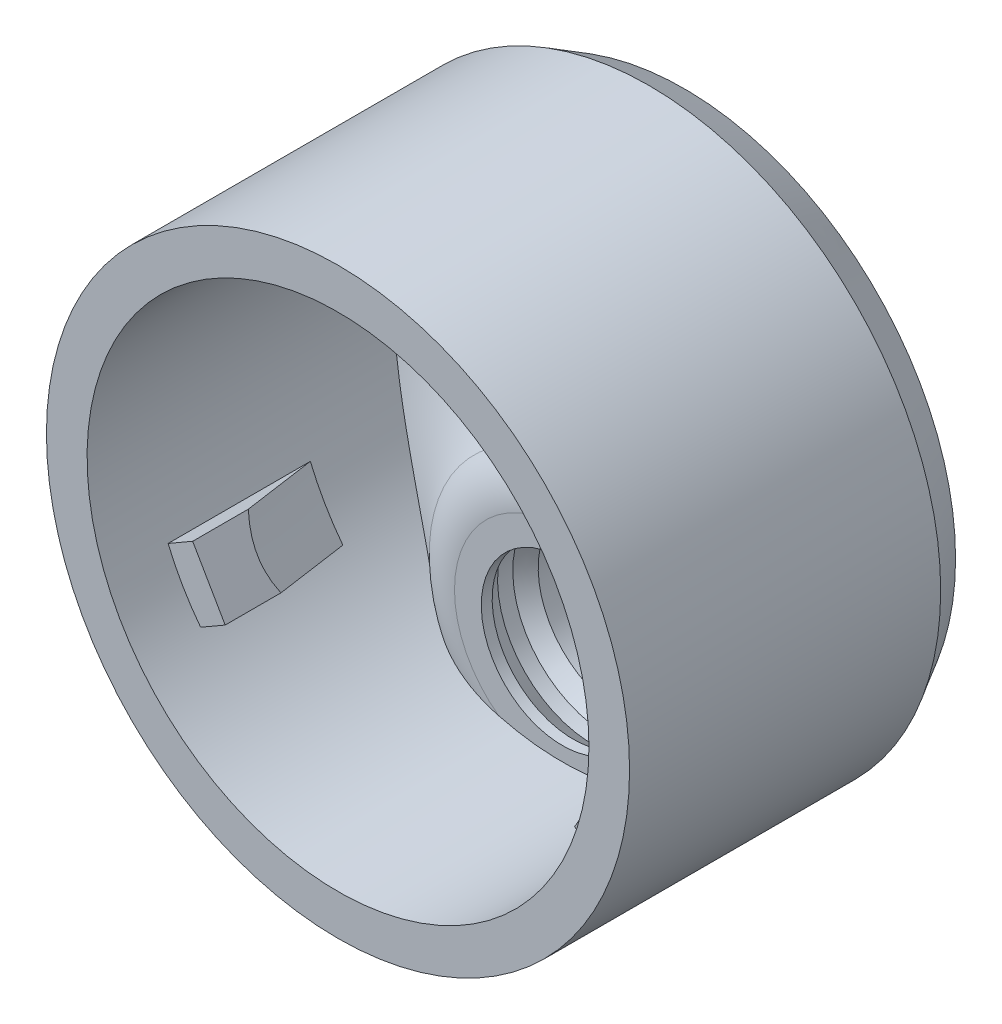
ISO-10303-21;
HEADER;
FILE_DESCRIPTION(('STEP AP214'),'2;1');
FILE_NAME('part.step','',(''),(''),'','','');
FILE_SCHEMA(('AUTOMOTIVE_DESIGN { 1 0 10303 214 1 1 1 1 }'));
ENDSEC;
DATA;
#1=APPLICATION_CONTEXT('core data for automotive mechanical design processes');
#2=APPLICATION_PROTOCOL_DEFINITION('international standard','automotive_design',2000,#1);
#3=PRODUCT_CONTEXT('',#1,'mechanical');
#4=PRODUCT('Part','Part','',(#3));
#5=PRODUCT_RELATED_PRODUCT_CATEGORY('part','',(#4));
#6=PRODUCT_DEFINITION_FORMATION('','',#4);
#7=PRODUCT_DEFINITION_CONTEXT('part definition',#1,'design');
#8=PRODUCT_DEFINITION('design','',#6,#7);
#9=PRODUCT_DEFINITION_SHAPE('','',#8);
#10=(LENGTH_UNIT() NAMED_UNIT(*) SI_UNIT(.MILLI.,.METRE.));
#11=(NAMED_UNIT(*) PLANE_ANGLE_UNIT() SI_UNIT($,.RADIAN.));
#12=(NAMED_UNIT(*) SI_UNIT($,.STERADIAN.) SOLID_ANGLE_UNIT());
#13=UNCERTAINTY_MEASURE_WITH_UNIT(LENGTH_MEASURE(1.E-05),#10,'distance_accuracy_value','');
#14=(GEOMETRIC_REPRESENTATION_CONTEXT(3) GLOBAL_UNCERTAINTY_ASSIGNED_CONTEXT((#13)) GLOBAL_UNIT_ASSIGNED_CONTEXT((#10,
#11,#12)) REPRESENTATION_CONTEXT('',''));
#15=CARTESIAN_POINT('',(0.,0.,0.));
#16=DIRECTION('',(0.,0.,1.));
#17=DIRECTION('',(1.,0.,0.));
#18=AXIS2_PLACEMENT_3D('',#15,#16,#17);
#19=CARTESIAN_POINT('',(0.,0.,17.0437230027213));
#20=DIRECTION('',(0.,0.,-1.));
#21=DIRECTION('',(-1.,0.,0.));
#22=AXIS2_PLACEMENT_3D('',#19,#20,#21);
#23=CYLINDRICAL_SURFACE('',#22,12.35);
#24=DIRECTION('',(0.,0.,-1.));
#25=VECTOR('',#24,1.);
#26=CARTESIAN_POINT('',(-11.405275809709,-4.7373181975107,17.0437230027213));
#27=LINE('',#26,#25);
#28=CARTESIAN_POINT('',(-11.405275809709,-4.7373181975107,6.99999999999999));
#29=VERTEX_POINT('',#28);
#30=CARTESIAN_POINT('',(-11.405275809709,-4.7373181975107,14.));
#31=VERTEX_POINT('',#30);
#32=EDGE_CURVE('E414',#29,#31,#27,.F.);
#33=ORIENTED_EDGE('',*,*,#32,.F.);
#34=CARTESIAN_POINT('',(0.,0.,6.99999999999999));
#35=DIRECTION('',(0.,0.,-1.));
#36=DIRECTION('',(-1.,0.,0.));
#37=AXIS2_PLACEMENT_3D('',#34,#35,#36);
#38=CIRCLE('',#37,12.35);
#39=CARTESIAN_POINT('',(-9.80527580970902,-7.5085994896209,6.99999999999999));
#40=VERTEX_POINT('',#39);
#41=EDGE_CURVE('E493',#29,#40,#38,.F.);
#42=ORIENTED_EDGE('',*,*,#41,.T.);
#43=DIRECTION('',(0.,0.,-1.));
#44=VECTOR('',#43,1.);
#45=CARTESIAN_POINT('',(-9.80527580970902,-7.5085994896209,17.0437230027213));
#46=LINE('',#45,#44);
#47=CARTESIAN_POINT('',(-9.80527580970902,-7.5085994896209,14.));
#48=VERTEX_POINT('',#47);
#49=EDGE_CURVE('E512',#48,#40,#46,.T.);
#50=ORIENTED_EDGE('',*,*,#49,.F.);
#51=CARTESIAN_POINT('',(0.,0.,14.));
#52=DIRECTION('',(0.,0.,-1.));
#53=DIRECTION('',(-1.,0.,0.));
#54=AXIS2_PLACEMENT_3D('',#51,#52,#53);
#55=CIRCLE('',#54,12.35);
#56=EDGE_CURVE('E521',#48,#31,#55,.T.);
#57=ORIENTED_EDGE('',*,*,#56,.T.);
#58=EDGE_LOOP('',(#33,#42,#50,#57));
#59=FACE_BOUND('',#58,.T.);
#60=CARTESIAN_POINT('',(12.3462335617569,0.304986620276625,2.));
#61=CARTESIAN_POINT('',(12.3539621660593,-0.00629316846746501,1.99999747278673));
#62=CARTESIAN_POINT('',(12.3498421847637,-0.317882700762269,2.0039492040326));
#63=CARTESIAN_POINT('',(12.3181249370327,-0.939653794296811,2.02057655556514));
#64=CARTESIAN_POINT('',(12.2905257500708,-1.24983523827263,2.03325288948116));
#65=CARTESIAN_POINT('',(12.2120462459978,-1.86688831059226,2.06815510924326));
#66=CARTESIAN_POINT('',(12.1611525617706,-2.17375793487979,2.09038647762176));
#67=CARTESIAN_POINT('',(12.0366053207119,-2.78189676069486,2.1451844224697));
#68=CARTESIAN_POINT('',(11.9629524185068,-3.08316612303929,2.17775070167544));
#69=CARTESIAN_POINT('',(11.7904002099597,-3.68945368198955,2.25542970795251));
#70=CARTESIAN_POINT('',(11.6906406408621,-3.99417218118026,2.30097589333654));
#71=CARTESIAN_POINT('',(11.4685779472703,-4.59306220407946,2.40478956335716));
#72=CARTESIAN_POINT('',(11.3462736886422,-4.88723319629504,2.46305768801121));
#73=CARTESIAN_POINT('',(11.0807830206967,-5.46250725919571,2.5929152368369));
#74=CARTESIAN_POINT('',(10.9376211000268,-5.74362515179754,2.66448906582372));
#75=CARTESIAN_POINT('',(10.6321278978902,-6.29115478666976,2.82155676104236));
#76=CARTESIAN_POINT('',(10.469797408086,-6.55756713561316,2.90705005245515));
#77=CARTESIAN_POINT('',(10.1317351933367,-7.06839698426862,3.09037909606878));
#78=CARTESIAN_POINT('',(9.95636570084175,-7.31316374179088,3.18791069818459));
#79=CARTESIAN_POINT('',(9.59146689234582,-7.7855859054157,3.3969292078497));
#80=CARTESIAN_POINT('',(9.40193724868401,-8.01324091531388,3.50841643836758));
#81=CARTESIAN_POINT('',(9.01083621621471,-8.4506521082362,3.74554036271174));
#82=CARTESIAN_POINT('',(8.80925026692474,-8.66038587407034,3.87119433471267));
#83=CARTESIAN_POINT('',(8.39670543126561,-9.0609314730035,4.13639641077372));
#84=CARTESIAN_POINT('',(8.18574774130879,-9.25174571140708,4.27594274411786));
#85=CARTESIAN_POINT('',(7.8019411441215,-9.57608639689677,4.53784952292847));
#86=CARTESIAN_POINT('',(7.63039128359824,-9.71322898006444,4.65766611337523));
#87=CARTESIAN_POINT('',(7.28411109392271,-9.97553987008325,4.90550788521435));
#88=CARTESIAN_POINT('',(7.10938092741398,-10.1007087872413,5.03353264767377));
#89=CARTESIAN_POINT('',(6.75843007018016,-10.3388073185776,5.29702664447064));
#90=CARTESIAN_POINT('',(6.58221638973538,-10.4517767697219,5.4324693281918));
#91=CARTESIAN_POINT('',(6.2287084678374,-10.66622986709,5.71076946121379));
#92=CARTESIAN_POINT('',(6.05141440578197,-10.7677153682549,5.85362570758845));
#93=CARTESIAN_POINT('',(5.87404565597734,-10.8636130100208,5.99999999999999));
#94=B_SPLINE_CURVE_WITH_KNOTS('',3,(#60,#61,#62,#63,#64,#65,#66,#67,#68,#69,#70,#71,#72,#73,#74,
#75,#76,#77,#78,#79,#80,#81,#82,#83,#84,#85,#86,#87,#88,#89,#90,#91,#92,#93),.UNSPECIFIED.,.F.,
.F.,(4,2,2,2,2,2,2,2,2,2,2,2,2,2,2,2,4),(0.,0.933903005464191,1.86788240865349,2.8023984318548,
3.73688757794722,4.7072327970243,5.67762684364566,6.64689061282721,7.61611436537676,
8.56454411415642,9.51299581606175,10.4626170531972,11.4121174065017,12.1622479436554,
12.9123402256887,13.6599039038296,14.4073466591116),.UNSPECIFIED.);
#95=CARTESIAN_POINT('',(12.3462335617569,0.304986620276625,2.));
#96=VERTEX_POINT('',#95);
#97=CARTESIAN_POINT('',(7.05222641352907,-10.1384714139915,5.07692307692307));
#98=VERTEX_POINT('',#97);
#99=EDGE_CURVE('E278',#96,#98,#94,.T.);
#100=ORIENTED_EDGE('',*,*,#99,.T.);
#101=CARTESIAN_POINT('',(7.05222641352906,-10.1384714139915,5.07692307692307));
#102=CARTESIAN_POINT('',(6.96275754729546,-10.2007302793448,5.14334075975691));
#103=CARTESIAN_POINT('',(6.87015922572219,-10.2633593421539,5.20500712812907));
#104=CARTESIAN_POINT('',(6.67968735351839,-10.38831512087,5.31950074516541));
#105=CARTESIAN_POINT('',(6.58182189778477,-10.4506421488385,5.37234107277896));
#106=CARTESIAN_POINT('',(6.38224641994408,-10.5736992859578,5.46968925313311));
#107=CARTESIAN_POINT('',(6.28056907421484,-10.6344376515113,5.51425424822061));
#108=CARTESIAN_POINT('',(6.07330104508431,-10.7541549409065,5.59620114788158));
#109=CARTESIAN_POINT('',(5.96770831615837,-10.8131329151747,5.63357923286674));
#110=CARTESIAN_POINT('',(5.68661083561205,-10.9646658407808,5.72291530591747));
#111=CARTESIAN_POINT('',(5.50838050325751,-11.0553479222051,5.7695290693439));
#112=CARTESIAN_POINT('',(5.14506224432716,-11.2290447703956,5.8479571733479));
#113=CARTESIAN_POINT('',(4.95997127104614,-11.3120560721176,5.87976485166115));
#114=CARTESIAN_POINT('',(4.58390332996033,-11.4696132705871,5.93101407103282));
#115=CARTESIAN_POINT('',(4.3929097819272,-11.544131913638,5.95041667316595));
#116=CARTESIAN_POINT('',(4.00677670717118,-11.6837665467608,5.97908334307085));
#117=CARTESIAN_POINT('',(3.81163679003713,-11.748881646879,5.98834645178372));
#118=CARTESIAN_POINT('',(3.53518465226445,-11.8335089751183,5.99595388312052));
#119=CARTESIAN_POINT('',(3.45517574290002,-11.8571169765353,5.99751555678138));
#120=CARTESIAN_POINT('',(3.29494592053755,-11.9026359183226,5.9995367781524));
#121=CARTESIAN_POINT('',(3.21472656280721,-11.9245521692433,5.99999992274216));
#122=CARTESIAN_POINT('',(3.1342898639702,-11.9456572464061,5.99999999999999));
#123=B_SPLINE_CURVE_WITH_KNOTS('',3,(#101,#102,#103,#104,#105,#106,#107,#108,#109,#110,#111,
#112,#113,#114,#115,#116,#117,#118,#119,#120,#121,#122),.UNSPECIFIED.,.F.,.F.,(4,2,2,2,2,2,2,2,
2,2,4),(0.,0.382653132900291,0.764734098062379,1.1440697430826,1.52360643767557,
2.13864248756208,2.75395501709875,3.3711896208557,3.98848260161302,4.23876604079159,
4.48822884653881),.UNSPECIFIED.);
#124=CARTESIAN_POINT('',(3.13428986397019,-11.9456572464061,5.99999999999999));
#125=VERTEX_POINT('',#124);
#126=EDGE_CURVE('E316',#98,#125,#123,.T.);
#127=ORIENTED_EDGE('',*,*,#126,.T.);
#128=CARTESIAN_POINT('',(0.,0.,5.99999999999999));
#129=DIRECTION('',(0.,0.,-1.));
#130=DIRECTION('',(0.,1.,0.));
#131=AXIS2_PLACEMENT_3D('',#128,#129,#130);
#132=CIRCLE('',#131,12.35);
#133=CARTESIAN_POINT('',(-3.13428986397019,-11.9456572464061,5.99999999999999));
#134=VERTEX_POINT('',#133);
#135=EDGE_CURVE('E274',#125,#134,#132,.T.);
#136=ORIENTED_EDGE('',*,*,#135,.T.);
#137=CARTESIAN_POINT('',(-3.1342898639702,-11.9456572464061,5.99999999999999));
#138=CARTESIAN_POINT('',(-3.35464931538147,-11.8878767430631,6.0000187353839));
#139=CARTESIAN_POINT('',(-3.57354760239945,-11.8238897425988,5.99652391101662));
#140=CARTESIAN_POINT('',(-4.00762094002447,-11.683893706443,5.97918363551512));
#141=CARTESIAN_POINT('',(-4.22278544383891,-11.6078553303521,5.96531260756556));
#142=CARTESIAN_POINT('',(-4.64070676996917,-11.4470477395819,5.92452526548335));
#143=CARTESIAN_POINT('',(-4.84364040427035,-11.3626348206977,5.89803962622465));
#144=CARTESIAN_POINT('',(-5.2423895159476,-11.1842496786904,5.82929715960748));
#145=CARTESIAN_POINT('',(-5.43821163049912,-11.0902866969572,5.78705547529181));
#146=CARTESIAN_POINT('',(-5.75742443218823,-10.9268145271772,5.70088381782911));
#147=CARTESIAN_POINT('',(-5.88334657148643,-10.8594984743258,5.66213494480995));
#148=CARTESIAN_POINT('',(-6.1302727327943,-10.7220434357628,5.57528026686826));
#149=CARTESIAN_POINT('',(-6.25127917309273,-10.6519058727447,5.52717913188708));
#150=CARTESIAN_POINT('',(-6.49001298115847,-10.5081857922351,5.41945198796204));
#151=CARTESIAN_POINT('',(-6.60761633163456,-10.4345617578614,5.35960313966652));
#152=CARTESIAN_POINT('',(-6.83568583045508,-10.2866261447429,5.22771563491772));
#153=CARTESIAN_POINT('',(-6.9461375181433,-10.2123135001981,5.1556532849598));
#154=CARTESIAN_POINT('',(-7.05222641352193,-10.1384714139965,5.07692307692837));
#155=B_SPLINE_CURVE_WITH_KNOTS('',3,(#137,#138,#139,#140,#141,#142,#143,#144,#145,#146,#147,
#148,#149,#150,#151,#152,#153,#154),.UNSPECIFIED.,.F.,.F.,(4,2,2,2,2,2,2,2,4),(0.,
0.683563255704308,1.36881703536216,2.03219080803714,2.69492865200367,3.13842914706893,
3.5817087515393,4.03439198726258,4.4879636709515),.UNSPECIFIED.);
#156=CARTESIAN_POINT('',(-7.05222641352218,-10.1384714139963,5.07692307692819));
#157=VERTEX_POINT('',#156);
#158=EDGE_CURVE('E322',#134,#157,#155,.T.);
#159=ORIENTED_EDGE('',*,*,#158,.T.);
#160=CARTESIAN_POINT('',(-5.87404565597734,-10.8636130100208,5.99999999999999));
#161=CARTESIAN_POINT('',(-6.00008280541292,-10.7954629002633,5.89600245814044));
#162=CARTESIAN_POINT('',(-6.12605683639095,-10.7245131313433,5.79378438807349));
#163=CARTESIAN_POINT('',(-6.37759460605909,-10.5768647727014,5.59302922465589));
#164=CARTESIAN_POINT('',(-6.5031582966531,-10.5001655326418,5.49449254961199));
#165=CARTESIAN_POINT('',(-6.87888971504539,-10.2611639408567,5.20452607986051));
#166=CARTESIAN_POINT('',(-7.12797144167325,-10.0900254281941,5.01884387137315));
#167=CARTESIAN_POINT('',(-7.62077294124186,-9.72321609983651,4.66342076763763));
#168=CARTESIAN_POINT('',(-7.86447613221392,-9.52747927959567,4.49372499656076));
#169=CARTESIAN_POINT('',(-8.34244687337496,-9.1118781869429,4.17157343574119));
#170=CARTESIAN_POINT('',(-8.57671684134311,-8.89202015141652,4.01911321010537));
#171=CARTESIAN_POINT('',(-9.03648869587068,-8.4245910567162,3.72922144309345));
#172=CARTESIAN_POINT('',(-9.26175959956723,-8.17659557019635,3.59210653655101));
#173=CARTESIAN_POINT('',(-9.69542297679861,-7.65739409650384,3.33617722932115));
#174=CARTESIAN_POINT('',(-9.90381332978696,-7.38618520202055,3.21736512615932));
#175=CARTESIAN_POINT('',(-10.2998672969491,-6.82301215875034,2.99806697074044));
#176=CARTESIAN_POINT('',(-10.4875732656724,-6.53109251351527,2.89754318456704));
#177=CARTESIAN_POINT('',(-10.8396937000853,-5.92834903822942,2.71402594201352));
#178=CARTESIAN_POINT('',(-11.0041116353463,-5.61752803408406,2.63102987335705));
#179=CARTESIAN_POINT('',(-11.2906292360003,-5.01431023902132,2.48991406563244));
#180=CARTESIAN_POINT('',(-11.4153846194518,-4.72357167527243,2.43007254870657));
#181=CARTESIAN_POINT('',(-11.6428178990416,-4.13133073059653,2.32306845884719));
#182=CARTESIAN_POINT('',(-11.7454966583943,-3.82982877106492,2.27590539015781));
#183=CARTESIAN_POINT('',(-11.9275798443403,-3.21825244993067,2.19351049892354));
#184=CARTESIAN_POINT('',(-12.0069815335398,-2.90817708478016,2.15828007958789));
#185=CARTESIAN_POINT('',(-12.1415831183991,-2.28189278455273,2.0989533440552));
#186=CARTESIAN_POINT('',(-12.1967906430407,-1.96568581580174,2.07485351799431));
#187=CARTESIAN_POINT('',(-12.2831462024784,-1.32410417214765,2.03660033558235));
#188=CARTESIAN_POINT('',(-12.3138876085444,-0.998664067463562,2.02261542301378));
#189=CARTESIAN_POINT('',(-12.3405518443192,-0.509766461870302,2.00889390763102));
#190=CARTESIAN_POINT('',(-12.3462035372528,-0.346877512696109,2.00552907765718));
#191=CARTESIAN_POINT('',(-12.3510571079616,-0.020976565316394,2.00108242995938));
#192=CARTESIAN_POINT('',(-12.3502591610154,0.142035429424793,2.00000055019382));
#193=CARTESIAN_POINT('',(-12.3462335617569,0.304986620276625,2.));
#194=B_SPLINE_CURVE_WITH_KNOTS('',3,(#160,#161,#162,#163,#164,#165,#166,#167,#168,#169,#170,
#171,#172,#173,#174,#175,#176,#177,#178,#179,#180,#181,#182,#183,#184,#185,#186,#187,#188,#189,
#190,#191,#192,#193),.UNSPECIFIED.,.F.,.F.,(4,2,2,2,2,2,2,2,2,2,2,2,2,2,2,2,4),(0.,
0.53107736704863,1.06221489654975,2.12501983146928,3.19074004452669,4.25618534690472,
5.34063820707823,6.42522708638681,7.50755212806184,8.589715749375,9.55450454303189,
10.5192556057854,11.4841200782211,12.4486800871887,13.4289546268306,13.9178964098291,
14.4068249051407),.UNSPECIFIED.);
#195=CARTESIAN_POINT('',(-12.3462335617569,0.304986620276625,2.));
#196=VERTEX_POINT('',#195);
#197=EDGE_CURVE('E287',#157,#196,#194,.T.);
#198=ORIENTED_EDGE('',*,*,#197,.T.);
#199=CARTESIAN_POINT('',(0.,0.,2.));
#200=DIRECTION('',(0.,0.,-1.));
#201=DIRECTION('',(-1.,0.,0.));
#202=AXIS2_PLACEMENT_3D('',#199,#200,#201);
#203=CIRCLE('',#202,12.35);
#204=EDGE_CURVE('E232',#196,#96,#203,.T.);
#205=ORIENTED_EDGE('',*,*,#204,.T.);
#206=EDGE_LOOP('',(#100,#127,#136,#159,#198,#205));
#207=FACE_BOUND('',#206,.T.);
#208=CARTESIAN_POINT('',(0.,0.,17.0437230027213));
#209=DIRECTION('',(0.,0.,1.));
#210=DIRECTION('',(1.,0.,0.));
#211=AXIS2_PLACEMENT_3D('',#208,#209,#210);
#212=CIRCLE('',#211,12.35);
#213=CARTESIAN_POINT('',(12.35,0.,17.0437230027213));
#214=VERTEX_POINT('',#213);
#215=EDGE_CURVE('E266',#214,#214,#212,.T.);
#216=ORIENTED_EDGE('',*,*,#215,.T.);
#217=EDGE_LOOP('',(#216));
#218=FACE_BOUND('',#217,.T.);
#219=DIRECTION('',(0.,0.,-1.));
#220=VECTOR('',#219,1.);
#221=CARTESIAN_POINT('',(1.6,12.2459176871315,17.0437230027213));
#222=LINE('',#221,#220);
#223=CARTESIAN_POINT('',(1.6,12.2459176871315,6.99999999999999));
#224=VERTEX_POINT('',#223);
#225=CARTESIAN_POINT('',(1.6,12.2459176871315,14.));
#226=VERTEX_POINT('',#225);
#227=EDGE_CURVE('E331',#224,#226,#222,.F.);
#228=ORIENTED_EDGE('',*,*,#227,.F.);
#229=CARTESIAN_POINT('',(0.,0.,6.99999999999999));
#230=DIRECTION('',(0.,0.,-1.));
#231=DIRECTION('',(-1.,0.,0.));
#232=AXIS2_PLACEMENT_3D('',#229,#230,#231);
#233=CIRCLE('',#232,12.35);
#234=CARTESIAN_POINT('',(-1.6,12.2459176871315,6.99999999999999));
#235=VERTEX_POINT('',#234);
#236=EDGE_CURVE('E337',#224,#235,#233,.F.);
#237=ORIENTED_EDGE('',*,*,#236,.T.);
#238=DIRECTION('',(0.,0.,-1.));
#239=VECTOR('',#238,1.);
#240=CARTESIAN_POINT('',(-1.6,12.2459176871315,17.0437230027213));
#241=LINE('',#240,#239);
#242=CARTESIAN_POINT('',(-1.6,12.2459176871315,14.));
#243=VERTEX_POINT('',#242);
#244=EDGE_CURVE('E328',#243,#235,#241,.T.);
#245=ORIENTED_EDGE('',*,*,#244,.F.);
#246=CARTESIAN_POINT('',(0.,0.,14.));
#247=DIRECTION('',(0.,0.,-1.));
#248=DIRECTION('',(-1.,0.,0.));
#249=AXIS2_PLACEMENT_3D('',#246,#247,#248);
#250=CIRCLE('',#249,12.35);
#251=EDGE_CURVE('E335',#243,#226,#250,.T.);
#252=ORIENTED_EDGE('',*,*,#251,.T.);
#253=EDGE_LOOP('',(#228,#237,#245,#252));
#254=FACE_BOUND('',#253,.T.);
#255=DIRECTION('',(0.,0.,-1.));
#256=VECTOR('',#255,1.);
#257=CARTESIAN_POINT('',(9.80527580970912,-7.50859948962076,17.0437230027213));
#258=LINE('',#257,#256);
#259=CARTESIAN_POINT('',(9.80527580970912,-7.50859948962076,6.99999999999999));
#260=VERTEX_POINT('',#259);
#261=CARTESIAN_POINT('',(9.80527580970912,-7.50859948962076,14.));
#262=VERTEX_POINT('',#261);
#263=EDGE_CURVE('E176',#260,#262,#258,.F.);
#264=ORIENTED_EDGE('',*,*,#263,.F.);
#265=CARTESIAN_POINT('',(0.,0.,6.99999999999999));
#266=DIRECTION('',(0.,0.,-1.));
#267=DIRECTION('',(-1.,0.,0.));
#268=AXIS2_PLACEMENT_3D('',#265,#266,#267);
#269=CIRCLE('',#268,12.35);
#270=CARTESIAN_POINT('',(11.4052758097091,-4.73731819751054,6.99999999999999));
#271=VERTEX_POINT('',#270);
#272=EDGE_CURVE('E424',#260,#271,#269,.F.);
#273=ORIENTED_EDGE('',*,*,#272,.T.);
#274=DIRECTION('',(0.,0.,-1.));
#275=VECTOR('',#274,1.);
#276=CARTESIAN_POINT('',(11.4052758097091,-4.73731819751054,17.0437230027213));
#277=LINE('',#276,#275);
#278=CARTESIAN_POINT('',(11.4052758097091,-4.73731819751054,14.));
#279=VERTEX_POINT('',#278);
#280=EDGE_CURVE('E427',#279,#271,#277,.T.);
#281=ORIENTED_EDGE('',*,*,#280,.F.);
#282=CARTESIAN_POINT('',(0.,0.,14.));
#283=DIRECTION('',(0.,0.,-1.));
#284=DIRECTION('',(-1.,0.,0.));
#285=AXIS2_PLACEMENT_3D('',#282,#283,#284);
#286=CIRCLE('',#285,12.35);
#287=EDGE_CURVE('E425',#279,#262,#286,.T.);
#288=ORIENTED_EDGE('',*,*,#287,.T.);
#289=EDGE_LOOP('',(#264,#273,#281,#288));
#290=FACE_BOUND('',#289,.T.);
#291=ADVANCED_FACE('F39',(#59,#207,#218,#254,#290),#23,.F.);
#292=CARTESIAN_POINT('',(0.,0.,17.0437230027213));
#293=DIRECTION('',(0.,0.,1.));
#294=DIRECTION('',(1.,0.,0.));
#295=AXIS2_PLACEMENT_3D('',#292,#293,#294);
#296=PLANE('',#295);
#297=CARTESIAN_POINT('',(0.,0.,17.0437230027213));
#298=DIRECTION('',(0.,0.,1.));
#299=DIRECTION('',(1.,0.,0.));
#300=AXIS2_PLACEMENT_3D('',#297,#298,#299);
#301=CIRCLE('',#300,14.35);
#302=CARTESIAN_POINT('',(14.35,0.,17.0437230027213));
#303=VERTEX_POINT('',#302);
#304=EDGE_CURVE('E270',#303,#303,#301,.T.);
#305=ORIENTED_EDGE('',*,*,#304,.T.);
#306=EDGE_LOOP('',(#305));
#307=FACE_BOUND('',#306,.T.);
#308=ORIENTED_EDGE('',*,*,#215,.F.);
#309=EDGE_LOOP('',(#308));
#310=FACE_BOUND('',#309,.T.);
#311=ADVANCED_FACE('F405',(#307,#310),#296,.T.);
#312=CARTESIAN_POINT('',(0.,0.,0.));
#313=DIRECTION('',(0.,0.,1.));
#314=DIRECTION('',(1.,0.,0.));
#315=AXIS2_PLACEMENT_3D('',#312,#313,#314);
#316=PLANE('',#315);
#317=CARTESIAN_POINT('',(0.,0.,0.));
#318=DIRECTION('',(0.,0.,1.));
#319=DIRECTION('',(1.,0.,0.));
#320=AXIS2_PLACEMENT_3D('',#317,#318,#319);
#321=CIRCLE('',#320,13.35);
#322=CARTESIAN_POINT('',(13.35,0.,0.));
#323=VERTEX_POINT('',#322);
#324=EDGE_CURVE('E11',#323,#323,#321,.F.);
#325=ORIENTED_EDGE('',*,*,#324,.T.);
#326=EDGE_LOOP('',(#325));
#327=FACE_BOUND('',#326,.T.);
#328=CARTESIAN_POINT('',(0.,-7.65835808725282,0.));
#329=DIRECTION('',(0.,0.,-1.));
#330=DIRECTION('',(0.,1.,0.));
#331=AXIS2_PLACEMENT_3D('',#328,#329,#330);
#332=CIRCLE('',#331,4.5);
#333=CARTESIAN_POINT('',(0.,-3.15835808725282,0.));
#334=VERTEX_POINT('',#333);
#335=EDGE_CURVE('E262',#334,#334,#332,.T.);
#336=ORIENTED_EDGE('',*,*,#335,.F.);
#337=EDGE_LOOP('',(#336));
#338=FACE_BOUND('',#337,.T.);
#339=ADVANCED_FACE('F400',(#327,#338),#316,.F.);
#340=CARTESIAN_POINT('',(0.,0.,17.0437230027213));
#341=DIRECTION('',(0.,0.,-1.));
#342=DIRECTION('',(-1.,0.,0.));
#343=AXIS2_PLACEMENT_3D('',#340,#341,#342);
#344=CYLINDRICAL_SURFACE('',#343,14.35);
#345=CARTESIAN_POINT('',(0.,0.,1.73205080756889));
#346=DIRECTION('',(0.,0.,1.));
#347=DIRECTION('',(1.,0.,0.));
#348=AXIS2_PLACEMENT_3D('',#345,#346,#347);
#349=CIRCLE('',#348,14.35);
#350=CARTESIAN_POINT('',(14.35,0.,1.73205080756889));
#351=VERTEX_POINT('',#350);
#352=EDGE_CURVE('E48',#351,#351,#349,.T.);
#353=ORIENTED_EDGE('',*,*,#352,.T.);
#354=EDGE_LOOP('',(#353));
#355=FACE_BOUND('',#354,.T.);
#356=ORIENTED_EDGE('',*,*,#304,.F.);
#357=EDGE_LOOP('',(#356));
#358=FACE_BOUND('',#357,.T.);
#359=ADVANCED_FACE('F303',(#355,#358),#344,.T.);
#360=CARTESIAN_POINT('',(0.,-7.65835808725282,0.));
#361=DIRECTION('',(0.,0.,-1.));
#362=DIRECTION('',(0.,1.,0.));
#363=AXIS2_PLACEMENT_3D('',#360,#361,#362);
#364=CONICAL_SURFACE('',#363,4.5,0.552620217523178);
#365=CARTESIAN_POINT('',(0.,-7.65835808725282,0.499999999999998));
#366=DIRECTION('',(0.,0.,-1.));
#367=DIRECTION('',(0.,1.,0.));
#368=AXIS2_PLACEMENT_3D('',#365,#366,#367);
#369=CIRCLE('',#368,4.19164191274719);
#370=CARTESIAN_POINT('',(0.,-3.46671617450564,0.499999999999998));
#371=VERTEX_POINT('',#370);
#372=EDGE_CURVE('E258',#371,#371,#369,.T.);
#373=ORIENTED_EDGE('',*,*,#372,.F.);
#374=EDGE_LOOP('',(#373));
#375=FACE_BOUND('',#374,.T.);
#376=ORIENTED_EDGE('',*,*,#335,.T.);
#377=EDGE_LOOP('',(#376));
#378=FACE_BOUND('',#377,.T.);
#379=ADVANCED_FACE('F393',(#375,#378),#364,.F.);
#380=CARTESIAN_POINT('',(0.,-7.65835808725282,-1.06047538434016));
#381=DIRECTION('',(0.,0.,-1.));
#382=DIRECTION('',(0.,1.,0.));
#383=AXIS2_PLACEMENT_3D('',#380,#381,#382);
#384=CYLINDRICAL_SURFACE('',#383,4.19164191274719);
#385=CARTESIAN_POINT('',(0.,-7.65835808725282,3.));
#386=DIRECTION('',(0.,0.,-1.));
#387=DIRECTION('',(0.,1.,0.));
#388=AXIS2_PLACEMENT_3D('',#385,#386,#387);
#389=CIRCLE('',#388,4.19164191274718);
#390=CARTESIAN_POINT('',(0.,-3.46671617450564,3.));
#391=VERTEX_POINT('',#390);
#392=EDGE_CURVE('E254',#391,#391,#389,.T.);
#393=ORIENTED_EDGE('',*,*,#392,.F.);
#394=EDGE_LOOP('',(#393));
#395=FACE_BOUND('',#394,.T.);
#396=ORIENTED_EDGE('',*,*,#372,.T.);
#397=EDGE_LOOP('',(#396));
#398=FACE_BOUND('',#397,.T.);
#399=ADVANCED_FACE('F390',(#395,#398),#384,.F.);
#400=CARTESIAN_POINT('',(0.,-7.65835808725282,3.));
#401=DIRECTION('',(0.,0.,1.));
#402=DIRECTION('',(0.,-1.,0.));
#403=AXIS2_PLACEMENT_3D('',#400,#401,#402);
#404=CONICAL_SURFACE('',#403,4.19164191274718,0.588002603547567);
#405=CARTESIAN_POINT('',(0.,-7.65835808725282,3.74999999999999));
#406=DIRECTION('',(0.,0.,-1.));
#407=DIRECTION('',(0.,1.,0.));
#408=AXIS2_PLACEMENT_3D('',#405,#406,#407);
#409=CIRCLE('',#408,4.69164191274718);
#410=CARTESIAN_POINT('',(0.,-2.96671617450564,3.74999999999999));
#411=VERTEX_POINT('',#410);
#412=EDGE_CURVE('E250',#411,#411,#409,.T.);
#413=ORIENTED_EDGE('',*,*,#412,.F.);
#414=EDGE_LOOP('',(#413));
#415=FACE_BOUND('',#414,.T.);
#416=ORIENTED_EDGE('',*,*,#392,.T.);
#417=EDGE_LOOP('',(#416));
#418=FACE_BOUND('',#417,.T.);
#419=ADVANCED_FACE('F386',(#415,#418),#404,.F.);
#420=CARTESIAN_POINT('',(0.,-7.65835808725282,-1.06047538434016));
#421=DIRECTION('',(0.,0.,-1.));
#422=DIRECTION('',(0.,1.,0.));
#423=AXIS2_PLACEMENT_3D('',#420,#421,#422);
#424=CYLINDRICAL_SURFACE('',#423,4.69164191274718);
#425=ORIENTED_EDGE('',*,*,#412,.T.);
#426=EDGE_LOOP('',(#425));
#427=FACE_BOUND('',#426,.T.);
#428=CARTESIAN_POINT('',(0.,-7.65835808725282,4.49999999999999));
#429=DIRECTION('',(0.,0.,-1.));
#430=DIRECTION('',(0.,1.,0.));
#431=AXIS2_PLACEMENT_3D('',#428,#429,#430);
#432=CIRCLE('',#431,4.69164191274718);
#433=CARTESIAN_POINT('',(0.,-2.96671617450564,4.49999999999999));
#434=VERTEX_POINT('',#433);
#435=EDGE_CURVE('E246',#434,#434,#432,.T.);
#436=ORIENTED_EDGE('',*,*,#435,.F.);
#437=EDGE_LOOP('',(#436));
#438=FACE_BOUND('',#437,.T.);
#439=ADVANCED_FACE('F382',(#427,#438),#424,.F.);
#440=CARTESIAN_POINT('',(0.,-7.65835808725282,4.49999999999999));
#441=DIRECTION('',(0.,0.,-1.));
#442=DIRECTION('',(0.,1.,0.));
#443=AXIS2_PLACEMENT_3D('',#440,#441,#442);
#444=CONICAL_SURFACE('',#443,4.69164191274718,0.627257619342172);
#445=CARTESIAN_POINT('',(0.,-7.65835808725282,5.46561999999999));
#446=DIRECTION('',(0.,0.,-1.));
#447=DIRECTION('',(0.,1.,0.));
#448=AXIS2_PLACEMENT_3D('',#445,#446,#447);
#449=CIRCLE('',#448,3.99164191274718);
#450=CARTESIAN_POINT('',(0.,-3.66671617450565,5.46561999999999));
#451=VERTEX_POINT('',#450);
#452=EDGE_CURVE('E242',#451,#451,#449,.T.);
#453=ORIENTED_EDGE('',*,*,#452,.F.);
#454=EDGE_LOOP('',(#453));
#455=FACE_BOUND('',#454,.T.);
#456=ORIENTED_EDGE('',*,*,#435,.T.);
#457=EDGE_LOOP('',(#456));
#458=FACE_BOUND('',#457,.T.);
#459=ADVANCED_FACE('F378',(#455,#458),#444,.F.);
#460=CARTESIAN_POINT('',(0.,-7.65835808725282,-1.06047538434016));
#461=DIRECTION('',(0.,0.,-1.));
#462=DIRECTION('',(0.,1.,0.));
#463=AXIS2_PLACEMENT_3D('',#460,#461,#462);
#464=CYLINDRICAL_SURFACE('',#463,3.99164191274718);
#465=CARTESIAN_POINT('',(0.,-7.65835808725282,5.99999999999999));
#466=DIRECTION('',(0.,0.,-1.));
#467=DIRECTION('',(0.,1.,0.));
#468=AXIS2_PLACEMENT_3D('',#465,#466,#467);
#469=CIRCLE('',#468,3.99164191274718);
#470=CARTESIAN_POINT('',(0.,-3.66671617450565,5.99999999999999));
#471=VERTEX_POINT('',#470);
#472=EDGE_CURVE('E238',#471,#471,#469,.T.);
#473=ORIENTED_EDGE('',*,*,#472,.F.);
#474=EDGE_LOOP('',(#473));
#475=FACE_BOUND('',#474,.T.);
#476=ORIENTED_EDGE('',*,*,#452,.T.);
#477=EDGE_LOOP('',(#476));
#478=FACE_BOUND('',#477,.T.);
#479=ADVANCED_FACE('F374',(#475,#478),#464,.F.);
#480=CARTESIAN_POINT('',(0.,-11.65,5.99999999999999));
#481=DIRECTION('',(0.,0.,-1.));
#482=DIRECTION('',(0.,1.,0.));
#483=AXIS2_PLACEMENT_3D('',#480,#481,#482);
#484=PLANE('',#483);
#485=ORIENTED_EDGE('',*,*,#135,.F.);
#486=CARTESIAN_POINT('',(0.,-7.65835808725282,5.99999999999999));
#487=DIRECTION('',(0.,0.,-1.));
#488=DIRECTION('',(0.,1.,0.));
#489=AXIS2_PLACEMENT_3D('',#486,#487,#488);
#490=CIRCLE('',#489,5.31081039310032);
#491=EDGE_CURVE('E761',#125,#134,#490,.F.);
#492=ORIENTED_EDGE('',*,*,#491,.T.);
#493=EDGE_LOOP('',(#485,#492));
#494=FACE_BOUND('',#493,.T.);
#495=ORIENTED_EDGE('',*,*,#472,.T.);
#496=EDGE_LOOP('',(#495));
#497=FACE_BOUND('',#496,.T.);
#498=ADVANCED_FACE('F370',(#494,#497),#484,.F.);
#499=CARTESIAN_POINT('',(0.,-3.82917904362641,2.));
#500=DIRECTION('',(0.,0.,-1.));
#501=DIRECTION('',(-1.,0.,0.));
#502=AXIS2_PLACEMENT_3D('',#499,#500,#501);
#503=PLANE('',#502);
#504=ORIENTED_EDGE('',*,*,#204,.F.);
#505=CARTESIAN_POINT('',(0.,-7.65835808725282,2.));
#506=DIRECTION('',(0.,0.,-1.));
#507=DIRECTION('',(-1.,0.,0.));
#508=AXIS2_PLACEMENT_3D('',#505,#506,#507);
#509=CIRCLE('',#508,14.6916419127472);
#510=EDGE_CURVE('E764',#196,#96,#509,.T.);
#511=ORIENTED_EDGE('',*,*,#510,.T.);
#512=EDGE_LOOP('',(#504,#511));
#513=FACE_BOUND('',#512,.T.);
#514=ADVANCED_FACE('F301',(#513),#503,.F.);
#515=CARTESIAN_POINT('',(0.,-7.65835808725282,12.));
#516=DIRECTION('',(0.,0.,-1.));
#517=DIRECTION('',(-1.,0.,0.));
#518=AXIS2_PLACEMENT_3D('',#515,#516,#517);
#519=TOROIDAL_SURFACE('',#518,14.6916419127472,10.);
#520=ORIENTED_EDGE('',*,*,#197,.F.);
#521=CARTESIAN_POINT('',(0.,-7.65835808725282,5.07692307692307));
#522=DIRECTION('',(0.,0.,1.));
#523=DIRECTION('',(0.,-1.,0.));
#524=AXIS2_PLACEMENT_3D('',#521,#522,#523);
#525=CIRCLE('',#524,7.47561766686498);
#526=EDGE_CURVE('E762',#157,#98,#525,.F.);
#527=ORIENTED_EDGE('',*,*,#526,.T.);
#528=ORIENTED_EDGE('',*,*,#99,.F.);
#529=ORIENTED_EDGE('',*,*,#510,.F.);
#530=EDGE_LOOP('',(#520,#527,#528,#529));
#531=FACE_BOUND('',#530,.T.);
#532=ADVANCED_FACE('F295',(#531),#519,.F.);
#533=CARTESIAN_POINT('',(0.,-7.65835808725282,2.99999999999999));
#534=DIRECTION('',(0.,0.,1.));
#535=DIRECTION('',(0.,-1.,0.));
#536=AXIS2_PLACEMENT_3D('',#533,#534,#535);
#537=TOROIDAL_SURFACE('',#536,5.31081039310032,3.);
#538=ORIENTED_EDGE('',*,*,#158,.F.);
#539=ORIENTED_EDGE('',*,*,#491,.F.);
#540=ORIENTED_EDGE('',*,*,#126,.F.);
#541=ORIENTED_EDGE('',*,*,#526,.F.);
#542=EDGE_LOOP('',(#538,#539,#540,#541));
#543=FACE_BOUND('',#542,.T.);
#544=ADVANCED_FACE('F300',(#543),#537,.T.);
#545=CARTESIAN_POINT('',(1.6,10.85,14.));
#546=DIRECTION('',(1.,0.,0.));
#547=DIRECTION('',(0.,1.,0.));
#548=AXIS2_PLACEMENT_3D('',#545,#546,#547);
#549=PLANE('',#548);
#550=DIRECTION('',(0.,0.,-1.));
#551=VECTOR('',#550,1.);
#552=CARTESIAN_POINT('',(1.6,10.85,14.));
#553=LINE('',#552,#551);
#554=CARTESIAN_POINT('',(1.6,10.85,14.));
#555=VERTEX_POINT('',#554);
#556=CARTESIAN_POINT('',(1.6,10.85,11.2553964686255));
#557=VERTEX_POINT('',#556);
#558=EDGE_CURVE('E228',#555,#557,#553,.T.);
#559=ORIENTED_EDGE('',*,*,#558,.T.);
#560=CARTESIAN_POINT('',(1.6,10.85,11.2553964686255));
#561=CARTESIAN_POINT('',(1.6,11.082892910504,10.546242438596));
#562=CARTESIAN_POINT('',(1.6,11.3156658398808,9.83704905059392));
#563=CARTESIAN_POINT('',(1.6,11.7809717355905,8.4185835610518));
#564=CARTESIAN_POINT('',(1.6,12.0135047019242,7.70931145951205));
#565=CARTESIAN_POINT('',(1.6,12.2459176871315,6.99999999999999));
#566=B_SPLINE_CURVE_WITH_KNOTS('',3,(#560,#561,#562,#563,#564,#565),.UNSPECIFIED.,.F.,.F.,(4,2,
4),(0.,2.23925132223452,4.47850263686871),.UNSPECIFIED.);
#567=EDGE_CURVE('E349',#557,#224,#566,.T.);
#568=ORIENTED_EDGE('',*,*,#567,.T.);
#569=ORIENTED_EDGE('',*,*,#227,.T.);
#570=DIRECTION('',(0.,-1.,0.));
#571=VECTOR('',#570,1.);
#572=CARTESIAN_POINT('',(1.6,10.85,14.));
#573=LINE('',#572,#571);
#574=EDGE_CURVE('E215',#226,#555,#573,.T.);
#575=ORIENTED_EDGE('',*,*,#574,.T.);
#576=EDGE_LOOP('',(#559,#568,#569,#575));
#577=FACE_BOUND('',#576,.T.);
#578=ADVANCED_FACE('F309',(#577),#549,.T.);
#579=CARTESIAN_POINT('',(-1.6,10.85,14.));
#580=DIRECTION('',(-1.,0.,0.));
#581=DIRECTION('',(0.,-1.,0.));
#582=AXIS2_PLACEMENT_3D('',#579,#580,#581);
#583=PLANE('',#582);
#584=DIRECTION('',(0.,1.,0.));
#585=VECTOR('',#584,1.);
#586=CARTESIAN_POINT('',(-1.6,10.85,14.));
#587=LINE('',#586,#585);
#588=CARTESIAN_POINT('',(-1.6,10.85,14.));
#589=VERTEX_POINT('',#588);
#590=EDGE_CURVE('E224',#589,#243,#587,.T.);
#591=ORIENTED_EDGE('',*,*,#590,.T.);
#592=ORIENTED_EDGE('',*,*,#244,.T.);
#593=CARTESIAN_POINT('',(-1.6,12.2459176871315,6.99999999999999));
#594=CARTESIAN_POINT('',(-1.6,12.0135047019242,7.70931145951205));
#595=CARTESIAN_POINT('',(-1.6,11.7809717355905,8.41858356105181));
#596=CARTESIAN_POINT('',(-1.6,11.3156658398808,9.83704905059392));
#597=CARTESIAN_POINT('',(-1.6,11.082892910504,10.546242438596));
#598=CARTESIAN_POINT('',(-1.6,10.85,11.2553964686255));
#599=B_SPLINE_CURVE_WITH_KNOTS('',3,(#593,#594,#595,#596,#597,#598),.UNSPECIFIED.,.F.,.F.,(4,2,
4),(0.,2.23925131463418,4.47850263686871),.UNSPECIFIED.);
#600=CARTESIAN_POINT('',(-1.6,10.85,11.2553964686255));
#601=VERTEX_POINT('',#600);
#602=EDGE_CURVE('E526',#235,#601,#599,.T.);
#603=ORIENTED_EDGE('',*,*,#602,.T.);
#604=DIRECTION('',(0.,0.,-1.));
#605=VECTOR('',#604,1.);
#606=CARTESIAN_POINT('',(-1.6,10.85,14.));
#607=LINE('',#606,#605);
#608=EDGE_CURVE('E229',#589,#601,#607,.T.);
#609=ORIENTED_EDGE('',*,*,#608,.F.);
#610=EDGE_LOOP('',(#591,#592,#603,#609));
#611=FACE_BOUND('',#610,.T.);
#612=ADVANCED_FACE('F360',(#611),#583,.T.);
#613=CARTESIAN_POINT('',(-1.6,10.85,14.));
#614=DIRECTION('',(0.,-1.,0.));
#615=DIRECTION('',(0.,0.,-1.));
#616=AXIS2_PLACEMENT_3D('',#613,#614,#615);
#617=PLANE('',#616);
#618=ORIENTED_EDGE('',*,*,#608,.T.);
#619=CARTESIAN_POINT('',(-1.6,10.85,11.2553964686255));
#620=CARTESIAN_POINT('',(-1.49947160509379,10.85,11.300554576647));
#621=CARTESIAN_POINT('',(-1.39731241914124,10.85,11.3422401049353));
#622=CARTESIAN_POINT('',(-1.18992847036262,10.85,11.4177978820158));
#623=CARTESIAN_POINT('',(-1.08469811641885,10.85,11.4516547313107));
#624=CARTESIAN_POINT('',(-0.872321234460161,10.85,11.5103492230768));
#625=CARTESIAN_POINT('',(-0.765187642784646,10.85,11.5352332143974));
#626=CARTESIAN_POINT('',(-0.549233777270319,10.85,11.5754105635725));
#627=CARTESIAN_POINT('',(-0.440415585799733,10.85,11.5907149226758));
#628=CARTESIAN_POINT('',(-0.276128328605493,10.85,11.6061429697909));
#629=CARTESIAN_POINT('',(-0.220992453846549,10.85,11.6100311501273));
#630=CARTESIAN_POINT('',(-0.110574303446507,10.85,11.615223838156));
#631=CARTESIAN_POINT('',(-0.055291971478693,10.85,11.616527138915));
#632=CARTESIAN_POINT('',(0.109934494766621,10.85,11.6165216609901));
#633=CARTESIAN_POINT('',(0.219907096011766,10.85,11.6113586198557));
#634=CARTESIAN_POINT('',(0.438926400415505,10.85,11.5909178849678));
#635=CARTESIAN_POINT('',(0.547972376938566,10.85,11.5756328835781));
#636=CARTESIAN_POINT('',(0.872773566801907,10.85,11.515241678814));
#637=CARTESIAN_POINT('',(1.08601360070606,10.85,11.4556005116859));
#638=CARTESIAN_POINT('',(1.34501052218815,10.85,11.3613100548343));
#639=CARTESIAN_POINT('',(1.39664368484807,10.85,11.3413754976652));
#640=CARTESIAN_POINT('',(1.49896976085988,10.85,11.2997116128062));
#641=CARTESIAN_POINT('',(1.54966534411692,10.85,11.2779888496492));
#642=CARTESIAN_POINT('',(1.60000000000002,10.85,11.2553964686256));
#643=B_SPLINE_CURVE_WITH_KNOTS('',3,(#619,#620,#621,#622,#623,#624,#625,#626,#627,#628,#629,
#630,#631,#632,#633,#634,#635,#636,#637,#638,#639,#640,#641,#642),.UNSPECIFIED.,.F.,.F.,(4,2,2,
2,2,2,2,2,2,2,2,4),(0.,0.330648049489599,0.661941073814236,0.991497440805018,1.32067464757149,
1.48643935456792,1.65228144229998,1.98201767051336,2.31199221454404,2.97246910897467,
3.13850658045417,3.30395960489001),.UNSPECIFIED.);
#644=EDGE_CURVE('E341',#601,#557,#643,.T.);
#645=ORIENTED_EDGE('',*,*,#644,.T.);
#646=ORIENTED_EDGE('',*,*,#558,.F.);
#647=DIRECTION('',(-1.,0.,0.));
#648=VECTOR('',#647,1.);
#649=CARTESIAN_POINT('',(-1.6,10.85,14.));
#650=LINE('',#649,#648);
#651=EDGE_CURVE('E220',#555,#589,#650,.T.);
#652=ORIENTED_EDGE('',*,*,#651,.T.);
#653=EDGE_LOOP('',(#618,#645,#646,#652));
#654=FACE_BOUND('',#653,.T.);
#655=ADVANCED_FACE('F355',(#654),#617,.T.);
#656=CARTESIAN_POINT('',(1.6,13.85,14.));
#657=DIRECTION('',(0.,0.,-1.));
#658=DIRECTION('',(-1.,0.,0.));
#659=AXIS2_PLACEMENT_3D('',#656,#657,#658);
#660=PLANE('',#659);
#661=ORIENTED_EDGE('',*,*,#251,.F.);
#662=ORIENTED_EDGE('',*,*,#590,.F.);
#663=ORIENTED_EDGE('',*,*,#651,.F.);
#664=ORIENTED_EDGE('',*,*,#574,.F.);
#665=EDGE_LOOP('',(#661,#662,#663,#664));
#666=FACE_BOUND('',#665,.T.);
#667=ADVANCED_FACE('F359',(#666),#660,.F.);
#668=CARTESIAN_POINT('',(0.,0.,12.));
#669=DIRECTION('',(0.,0.,-1.));
#670=DIRECTION('',(-1.,0.,0.));
#671=AXIS2_PLACEMENT_3D('',#668,#669,#670);
#672=CONICAL_SURFACE('',#671,10.7254015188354,0.314159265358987);
#673=ORIENTED_EDGE('',*,*,#602,.F.);
#674=ORIENTED_EDGE('',*,*,#236,.F.);
#675=ORIENTED_EDGE('',*,*,#567,.F.);
#676=ORIENTED_EDGE('',*,*,#644,.F.);
#677=EDGE_LOOP('',(#673,#674,#675,#676));
#678=FACE_BOUND('',#677,.T.);
#679=ADVANCED_FACE('F311',(#678),#672,.F.);
#680=CARTESIAN_POINT('',(-10.1963756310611,-4.03935935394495,14.));
#681=DIRECTION('',(-0.500000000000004,0.866025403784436,0.));
#682=DIRECTION('',(-0.866025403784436,-0.500000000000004,0.));
#683=AXIS2_PLACEMENT_3D('',#680,#681,#682);
#684=PLANE('',#683);
#685=DIRECTION('',(0.,0.,-1.));
#686=VECTOR('',#685,1.);
#687=CARTESIAN_POINT('',(-10.1963756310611,-4.03935935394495,14.));
#688=LINE('',#687,#686);
#689=CARTESIAN_POINT('',(-10.1963756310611,-4.03935935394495,14.));
#690=VERTEX_POINT('',#689);
#691=CARTESIAN_POINT('',(-10.1963756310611,-4.03935935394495,11.2553964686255));
#692=VERTEX_POINT('',#691);
#693=EDGE_CURVE('E211',#690,#692,#688,.T.);
#694=ORIENTED_EDGE('',*,*,#693,.T.);
#695=CARTESIAN_POINT('',(-10.1963756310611,-4.03935935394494,11.2553964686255));
#696=CARTESIAN_POINT('',(-10.3980668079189,-4.15580580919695,10.546242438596));
#697=CARTESIAN_POINT('',(-10.5996540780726,-4.27219227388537,9.83704905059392));
#698=CARTESIAN_POINT('',(-11.0026208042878,-4.50484522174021,8.4185835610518));
#699=CARTESIAN_POINT('',(-11.2040002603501,-4.62111170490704,7.70931145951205));
#700=CARTESIAN_POINT('',(-11.405275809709,-4.7373181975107,6.99999999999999));
#701=B_SPLINE_CURVE_WITH_KNOTS('',3,(#695,#696,#697,#698,#699,#700),.UNSPECIFIED.,.F.,.F.,(4,2,
4),(0.,2.23925132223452,4.4785026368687),.UNSPECIFIED.);
#702=EDGE_CURVE('E444',#692,#29,#701,.T.);
#703=ORIENTED_EDGE('',*,*,#702,.T.);
#704=ORIENTED_EDGE('',*,*,#32,.T.);
#705=DIRECTION('',(0.866025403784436,0.500000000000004,0.));
#706=VECTOR('',#705,1.);
#707=CARTESIAN_POINT('',(-10.1963756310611,-4.03935935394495,14.));
#708=LINE('',#707,#706);
#709=EDGE_CURVE('E199',#31,#690,#708,.T.);
#710=ORIENTED_EDGE('',*,*,#709,.T.);
#711=EDGE_LOOP('',(#694,#703,#704,#710));
#712=FACE_BOUND('',#711,.T.);
#713=ADVANCED_FACE('F478',(#712),#684,.T.);
#714=CARTESIAN_POINT('',(-8.59637563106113,-6.81064064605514,14.));
#715=DIRECTION('',(0.500000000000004,-0.866025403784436,0.));
#716=DIRECTION('',(0.866025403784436,0.500000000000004,0.));
#717=AXIS2_PLACEMENT_3D('',#714,#715,#716);
#718=PLANE('',#717);
#719=DIRECTION('',(-0.866025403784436,-0.500000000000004,0.));
#720=VECTOR('',#719,1.);
#721=CARTESIAN_POINT('',(-8.59637563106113,-6.81064064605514,14.));
#722=LINE('',#721,#720);
#723=CARTESIAN_POINT('',(-8.59637563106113,-6.81064064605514,14.));
#724=VERTEX_POINT('',#723);
#725=EDGE_CURVE('E207',#724,#48,#722,.T.);
#726=ORIENTED_EDGE('',*,*,#725,.T.);
#727=ORIENTED_EDGE('',*,*,#49,.T.);
#728=CARTESIAN_POINT('',(-9.80527580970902,-7.5085994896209,6.99999999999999));
#729=CARTESIAN_POINT('',(-9.60400026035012,-7.39239299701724,7.70931145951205));
#730=CARTESIAN_POINT('',(-9.40262080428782,-7.27612651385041,8.41858356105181));
#731=CARTESIAN_POINT('',(-8.99965407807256,-7.04347356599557,9.83704905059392));
#732=CARTESIAN_POINT('',(-8.79806680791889,-6.92708710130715,10.546242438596));
#733=CARTESIAN_POINT('',(-8.59637563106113,-6.81064064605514,11.2553964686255));
#734=B_SPLINE_CURVE_WITH_KNOTS('',3,(#728,#729,#730,#731,#732,#733),.UNSPECIFIED.,.F.,.F.,(4,2,
4),(0.,2.23925131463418,4.47850263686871),.UNSPECIFIED.);
#735=CARTESIAN_POINT('',(-8.59637563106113,-6.81064064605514,11.2553964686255));
#736=VERTEX_POINT('',#735);
#737=EDGE_CURVE('E437',#40,#736,#734,.T.);
#738=ORIENTED_EDGE('',*,*,#737,.T.);
#739=DIRECTION('',(0.,0.,-1.));
#740=VECTOR('',#739,1.);
#741=CARTESIAN_POINT('',(-8.59637563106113,-6.81064064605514,14.));
#742=LINE('',#741,#740);
#743=EDGE_CURVE('E212',#724,#736,#742,.T.);
#744=ORIENTED_EDGE('',*,*,#743,.F.);
#745=EDGE_LOOP('',(#726,#727,#738,#744));
#746=FACE_BOUND('',#745,.T.);
#747=ADVANCED_FACE('F474',(#746),#718,.T.);
#748=CARTESIAN_POINT('',(-8.59637563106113,-6.81064064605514,14.));
#749=DIRECTION('',(0.866025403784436,0.500000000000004,0.));
#750=DIRECTION('',(-0.500000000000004,0.866025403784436,0.));
#751=AXIS2_PLACEMENT_3D('',#748,#749,#750);
#752=PLANE('',#751);
#753=ORIENTED_EDGE('',*,*,#743,.T.);
#754=CARTESIAN_POINT('',(-8.59637563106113,-6.81064064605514,11.2553964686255));
#755=CARTESIAN_POINT('',(-8.64663982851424,-6.72358050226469,11.300554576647));
#756=CARTESIAN_POINT('',(-8.69771942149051,-6.63510805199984,11.3422401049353));
#757=CARTESIAN_POINT('',(-8.80141139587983,-6.45550828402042,11.4177978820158));
#758=CARTESIAN_POINT('',(-8.85402657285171,-6.36437612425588,11.4516547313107));
#759=CARTESIAN_POINT('',(-8.96021501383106,-6.18045234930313,11.5103492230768));
#760=CARTESIAN_POINT('',(-9.01378180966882,-6.08767193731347,11.5352332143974));
#761=CARTESIAN_POINT('',(-9.12175874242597,-5.90065040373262,11.5754105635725));
#762=CARTESIAN_POINT('',(-9.17616783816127,-5.80641108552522,11.5907149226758));
#763=CARTESIAN_POINT('',(-9.25831146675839,-5.66413414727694,11.6061429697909));
#764=CARTESIAN_POINT('',(-9.28587940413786,-5.61638507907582,11.6100311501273));
#765=CARTESIAN_POINT('',(-9.34108847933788,-5.52076015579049,11.615223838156));
#766=CARTESIAN_POINT('',(-9.36872964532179,-5.47288425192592,11.616527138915));
#767=CARTESIAN_POINT('',(-9.45134287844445,-5.32979393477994,11.6165216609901));
#768=CARTESIAN_POINT('',(-9.50632917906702,-5.23455486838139,11.6113586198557));
#769=CARTESIAN_POINT('',(-9.61583883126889,-5.04487858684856,11.5909178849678));
#770=CARTESIAN_POINT('',(-9.67036181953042,-4.95044200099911,11.5756328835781));
#771=CARTESIAN_POINT('',(-9.83276241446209,-4.66915591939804,11.515241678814));
#772=CARTESIAN_POINT('',(-9.93938243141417,-4.48448463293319,11.4556005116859));
#773=CARTESIAN_POINT('',(-10.0688808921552,-4.26018671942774,11.3613100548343));
#774=CARTESIAN_POINT('',(-10.0946974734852,-4.21547108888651,11.3413754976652));
#775=CARTESIAN_POINT('',(-10.1458605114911,-4.12685410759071,11.2997116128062));
#776=CARTESIAN_POINT('',(-10.1712083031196,-4.08295044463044,11.2779888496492));
#777=CARTESIAN_POINT('',(-10.1963756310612,-4.03935935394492,11.2553964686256));
#778=B_SPLINE_CURVE_WITH_KNOTS('',3,(#754,#755,#756,#757,#758,#759,#760,#761,#762,#763,#764,
#765,#766,#767,#768,#769,#770,#771,#772,#773,#774,#775,#776,#777),.UNSPECIFIED.,.F.,.F.,(4,2,2,
2,2,2,2,2,2,2,2,4),(0.,0.330648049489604,0.661941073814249,0.991497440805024,1.32067464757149,
1.48643935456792,1.65228144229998,1.98201767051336,2.31199221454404,2.97246910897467,
3.13850658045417,3.30395960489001),.UNSPECIFIED.);
#779=EDGE_CURVE('E486',#736,#692,#778,.T.);
#780=ORIENTED_EDGE('',*,*,#779,.T.);
#781=ORIENTED_EDGE('',*,*,#693,.F.);
#782=DIRECTION('',(0.500000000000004,-0.866025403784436,0.));
#783=VECTOR('',#782,1.);
#784=CARTESIAN_POINT('',(-8.59637563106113,-6.81064064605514,14.));
#785=LINE('',#784,#783);
#786=EDGE_CURVE('E203',#690,#724,#785,.T.);
#787=ORIENTED_EDGE('',*,*,#786,.T.);
#788=EDGE_LOOP('',(#753,#780,#781,#787));
#789=FACE_BOUND('',#788,.T.);
#790=ADVANCED_FACE('F472',(#789),#752,.T.);
#791=CARTESIAN_POINT('',(-12.7944518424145,-5.53935935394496,14.));
#792=DIRECTION('',(0.,0.,-1.));
#793=DIRECTION('',(0.500000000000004,-0.866025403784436,0.));
#794=AXIS2_PLACEMENT_3D('',#791,#792,#793);
#795=PLANE('',#794);
#796=ORIENTED_EDGE('',*,*,#56,.F.);
#797=ORIENTED_EDGE('',*,*,#725,.F.);
#798=ORIENTED_EDGE('',*,*,#786,.F.);
#799=ORIENTED_EDGE('',*,*,#709,.F.);
#800=EDGE_LOOP('',(#796,#797,#798,#799));
#801=FACE_BOUND('',#800,.T.);
#802=ADVANCED_FACE('F470',(#801),#795,.F.);
#803=CARTESIAN_POINT('',(8.59637563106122,-6.81064064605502,14.));
#804=DIRECTION('',(-0.499999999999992,-0.866025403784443,0.));
#805=DIRECTION('',(0.866025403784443,-0.499999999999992,0.));
#806=AXIS2_PLACEMENT_3D('',#803,#804,#805);
#807=PLANE('',#806);
#808=DIRECTION('',(0.,0.,-1.));
#809=VECTOR('',#808,1.);
#810=CARTESIAN_POINT('',(8.59637563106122,-6.81064064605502,14.));
#811=LINE('',#810,#809);
#812=CARTESIAN_POINT('',(8.59637563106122,-6.81064064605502,14.));
#813=VERTEX_POINT('',#812);
#814=CARTESIAN_POINT('',(8.59637563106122,-6.81064064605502,11.2553964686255));
#815=VERTEX_POINT('',#814);
#816=EDGE_CURVE('E67',#813,#815,#811,.T.);
#817=ORIENTED_EDGE('',*,*,#816,.T.);
#818=CARTESIAN_POINT('',(8.59637563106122,-6.81064064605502,11.2553964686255));
#819=CARTESIAN_POINT('',(8.79806680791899,-6.92708710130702,10.546242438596));
#820=CARTESIAN_POINT('',(8.99965407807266,-7.04347356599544,9.83704905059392));
#821=CARTESIAN_POINT('',(9.40262080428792,-7.27612651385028,8.41858356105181));
#822=CARTESIAN_POINT('',(9.60400026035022,-7.39239299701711,7.70931145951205));
#823=CARTESIAN_POINT('',(9.80527580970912,-7.50859948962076,6.99999999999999));
#824=B_SPLINE_CURVE_WITH_KNOTS('',3,(#818,#819,#820,#821,#822,#823),.UNSPECIFIED.,.F.,.F.,(4,2,
4),(0.,2.23925132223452,4.47850263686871),.UNSPECIFIED.);
#825=EDGE_CURVE('E429',#815,#260,#824,.T.);
#826=ORIENTED_EDGE('',*,*,#825,.T.);
#827=ORIENTED_EDGE('',*,*,#263,.T.);
#828=DIRECTION('',(-0.866025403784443,0.499999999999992,0.));
#829=VECTOR('',#828,1.);
#830=CARTESIAN_POINT('',(8.59637563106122,-6.81064064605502,14.));
#831=LINE('',#830,#829);
#832=EDGE_CURVE('E174',#262,#813,#831,.T.);
#833=ORIENTED_EDGE('',*,*,#832,.T.);
#834=EDGE_LOOP('',(#817,#826,#827,#833));
#835=FACE_BOUND('',#834,.T.);
#836=ADVANCED_FACE('F175',(#835),#807,.T.);
#837=CARTESIAN_POINT('',(10.1963756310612,-4.0393593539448,14.));
#838=DIRECTION('',(0.499999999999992,0.866025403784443,0.));
#839=DIRECTION('',(-0.866025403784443,0.499999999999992,0.));
#840=AXIS2_PLACEMENT_3D('',#837,#838,#839);
#841=PLANE('',#840);
#842=DIRECTION('',(0.866025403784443,-0.499999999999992,0.));
#843=VECTOR('',#842,1.);
#844=CARTESIAN_POINT('',(10.1963756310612,-4.0393593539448,14.));
#845=LINE('',#844,#843);
#846=CARTESIAN_POINT('',(10.1963756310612,-4.0393593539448,14.));
#847=VERTEX_POINT('',#846);
#848=EDGE_CURVE('E188',#847,#279,#845,.T.);
#849=ORIENTED_EDGE('',*,*,#848,.T.);
#850=ORIENTED_EDGE('',*,*,#280,.T.);
#851=CARTESIAN_POINT('',(11.4052758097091,-4.73731819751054,6.99999999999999));
#852=CARTESIAN_POINT('',(11.2040002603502,-4.62111170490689,7.70931145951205));
#853=CARTESIAN_POINT('',(11.0026208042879,-4.50484522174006,8.41858356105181));
#854=CARTESIAN_POINT('',(10.5996540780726,-4.27219227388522,9.83704905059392));
#855=CARTESIAN_POINT('',(10.398066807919,-4.15580580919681,10.546242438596));
#856=CARTESIAN_POINT('',(10.1963756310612,-4.0393593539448,11.2553964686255));
#857=B_SPLINE_CURVE_WITH_KNOTS('',3,(#851,#852,#853,#854,#855,#856),.UNSPECIFIED.,.F.,.F.,(4,2,
4),(0.,2.23925131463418,4.47850263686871),.UNSPECIFIED.);
#858=CARTESIAN_POINT('',(10.1963756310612,-4.0393593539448,11.2553964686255));
#859=VERTEX_POINT('',#858);
#860=EDGE_CURVE('E432',#271,#859,#857,.T.);
#861=ORIENTED_EDGE('',*,*,#860,.T.);
#862=DIRECTION('',(0.,0.,-1.));
#863=VECTOR('',#862,1.);
#864=CARTESIAN_POINT('',(10.1963756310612,-4.0393593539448,14.));
#865=LINE('',#864,#863);
#866=EDGE_CURVE('E58',#847,#859,#865,.T.);
#867=ORIENTED_EDGE('',*,*,#866,.F.);
#868=EDGE_LOOP('',(#849,#850,#861,#867));
#869=FACE_BOUND('',#868,.T.);
#870=ADVANCED_FACE('F464',(#869),#841,.T.);
#871=CARTESIAN_POINT('',(10.1963756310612,-4.0393593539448,14.));
#872=DIRECTION('',(-0.866025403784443,0.499999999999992,0.));
#873=DIRECTION('',(-0.499999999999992,-0.866025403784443,0.));
#874=AXIS2_PLACEMENT_3D('',#871,#872,#873);
#875=PLANE('',#874);
#876=ORIENTED_EDGE('',*,*,#866,.T.);
#877=CARTESIAN_POINT('',(10.1963756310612,-4.0393593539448,11.2553964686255));
#878=CARTESIAN_POINT('',(10.1461114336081,-4.12641949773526,11.300554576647));
#879=CARTESIAN_POINT('',(10.0950318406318,-4.21489194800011,11.3422401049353));
#880=CARTESIAN_POINT('',(9.9913398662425,-4.39449171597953,11.4177978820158));
#881=CARTESIAN_POINT('',(9.93872468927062,-4.48562387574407,11.4516547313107));
#882=CARTESIAN_POINT('',(9.83253624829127,-4.66954765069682,11.5103492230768));
#883=CARTESIAN_POINT('',(9.77896945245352,-4.76232806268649,11.5352332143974));
#884=CARTESIAN_POINT('',(9.67099251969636,-4.94934959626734,11.5754105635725));
#885=CARTESIAN_POINT('',(9.61658342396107,-5.04358891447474,11.5907149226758));
#886=CARTESIAN_POINT('',(9.53443979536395,-5.18586585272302,11.6061429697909));
#887=CARTESIAN_POINT('',(9.50687185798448,-5.23361492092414,11.6100311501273));
#888=CARTESIAN_POINT('',(9.45166278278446,-5.32923984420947,11.615223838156));
#889=CARTESIAN_POINT('',(9.42402161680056,-5.37711574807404,11.616527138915));
#890=CARTESIAN_POINT('',(9.3414083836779,-5.52020606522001,11.6165216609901));
#891=CARTESIAN_POINT('',(9.28642208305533,-5.61544513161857,11.6113586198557));
#892=CARTESIAN_POINT('',(9.17691243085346,-5.8051214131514,11.5909178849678));
#893=CARTESIAN_POINT('',(9.12238944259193,-5.89955799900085,11.5756328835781));
#894=CARTESIAN_POINT('',(8.95998884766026,-6.18084408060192,11.515241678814));
#895=CARTESIAN_POINT('',(8.85336883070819,-6.36551536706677,11.4556005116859));
#896=CARTESIAN_POINT('',(8.72387036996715,-6.58981328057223,11.3613100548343));
#897=CARTESIAN_POINT('',(8.69805378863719,-6.63452891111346,11.3413754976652));
#898=CARTESIAN_POINT('',(8.64689075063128,-6.72314589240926,11.2997116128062));
#899=CARTESIAN_POINT('',(8.62154295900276,-6.76704955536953,11.2779888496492));
#900=CARTESIAN_POINT('',(8.59637563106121,-6.81064064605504,11.2553964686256));
#901=B_SPLINE_CURVE_WITH_KNOTS('',3,(#877,#878,#879,#880,#881,#882,#883,#884,#885,#886,#887,
#888,#889,#890,#891,#892,#893,#894,#895,#896,#897,#898,#899,#900),.UNSPECIFIED.,.F.,.F.,(4,2,2,
2,2,2,2,2,2,2,2,4),(0.,0.330648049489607,0.661941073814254,0.991497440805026,1.32067464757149,
1.48643935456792,1.65228144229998,1.98201767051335,2.31199221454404,2.97246910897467,
3.13850658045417,3.30395960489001),.UNSPECIFIED.);
#902=EDGE_CURVE('E185',#859,#815,#901,.T.);
#903=ORIENTED_EDGE('',*,*,#902,.T.);
#904=ORIENTED_EDGE('',*,*,#816,.F.);
#905=DIRECTION('',(0.499999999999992,0.866025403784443,0.));
#906=VECTOR('',#905,1.);
#907=CARTESIAN_POINT('',(10.1963756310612,-4.0393593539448,14.));
#908=LINE('',#907,#906);
#909=EDGE_CURVE('E181',#813,#847,#908,.T.);
#910=ORIENTED_EDGE('',*,*,#909,.T.);
#911=EDGE_LOOP('',(#876,#903,#904,#910));
#912=FACE_BOUND('',#911,.T.);
#913=ADVANCED_FACE('F183',(#912),#875,.T.);
#914=CARTESIAN_POINT('',(11.1944518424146,-8.310640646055,14.));
#915=DIRECTION('',(0.,0.,-1.));
#916=DIRECTION('',(0.499999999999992,0.866025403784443,0.));
#917=AXIS2_PLACEMENT_3D('',#914,#915,#916);
#918=PLANE('',#917);
#919=ORIENTED_EDGE('',*,*,#287,.F.);
#920=ORIENTED_EDGE('',*,*,#848,.F.);
#921=ORIENTED_EDGE('',*,*,#909,.F.);
#922=ORIENTED_EDGE('',*,*,#832,.F.);
#923=EDGE_LOOP('',(#919,#920,#921,#922));
#924=FACE_BOUND('',#923,.T.);
#925=ADVANCED_FACE('F191',(#924),#918,.F.);
#926=CARTESIAN_POINT('',(0.,0.,12.));
#927=DIRECTION('',(0.,0.,-1.));
#928=DIRECTION('',(-1.,0.,0.));
#929=AXIS2_PLACEMENT_3D('',#926,#927,#928);
#930=CONICAL_SURFACE('',#929,10.7254015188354,0.314159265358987);
#931=ORIENTED_EDGE('',*,*,#737,.F.);
#932=ORIENTED_EDGE('',*,*,#41,.F.);
#933=ORIENTED_EDGE('',*,*,#702,.F.);
#934=ORIENTED_EDGE('',*,*,#779,.F.);
#935=EDGE_LOOP('',(#931,#932,#933,#934));
#936=FACE_BOUND('',#935,.T.);
#937=ADVANCED_FACE('F498',(#936),#930,.F.);
#938=CARTESIAN_POINT('',(0.,0.,12.));
#939=DIRECTION('',(0.,0.,-1.));
#940=DIRECTION('',(-1.,0.,0.));
#941=AXIS2_PLACEMENT_3D('',#938,#939,#940);
#942=CONICAL_SURFACE('',#941,10.7254015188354,0.314159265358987);
#943=ORIENTED_EDGE('',*,*,#860,.F.);
#944=ORIENTED_EDGE('',*,*,#272,.F.);
#945=ORIENTED_EDGE('',*,*,#825,.F.);
#946=ORIENTED_EDGE('',*,*,#902,.F.);
#947=EDGE_LOOP('',(#943,#944,#945,#946));
#948=FACE_BOUND('',#947,.T.);
#949=ADVANCED_FACE('F435',(#948),#942,.F.);
#950=CARTESIAN_POINT('',(0.,0.,1.73205080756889));
#951=DIRECTION('',(0.,0.,1.));
#952=DIRECTION('',(1.,0.,0.));
#953=AXIS2_PLACEMENT_3D('',#950,#951,#952);
#954=CONICAL_SURFACE('',#953,14.35,0.5235987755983);
#955=ORIENTED_EDGE('',*,*,#324,.F.);
#956=EDGE_LOOP('',(#955));
#957=FACE_BOUND('',#956,.T.);
#958=ORIENTED_EDGE('',*,*,#352,.F.);
#959=EDGE_LOOP('',(#958));
#960=FACE_BOUND('',#959,.T.);
#961=ADVANCED_FACE('F41',(#957,#960),#954,.T.);
#962=CLOSED_SHELL('',(#291,#311,#339,#359,#379,#399,#419,#439,#459,#479,#498,#514,#532,#544,
#578,#612,#655,#667,#679,#713,#747,#790,#802,#836,#870,#913,#925,#937,#949,#961));
#963=MANIFOLD_SOLID_BREP('B2',#962);
#964=ADVANCED_BREP_SHAPE_REPRESENTATION('',(#18,#963),#14);
#965=SHAPE_DEFINITION_REPRESENTATION(#9,#964);
ENDSEC;
END-ISO-10303-21;
